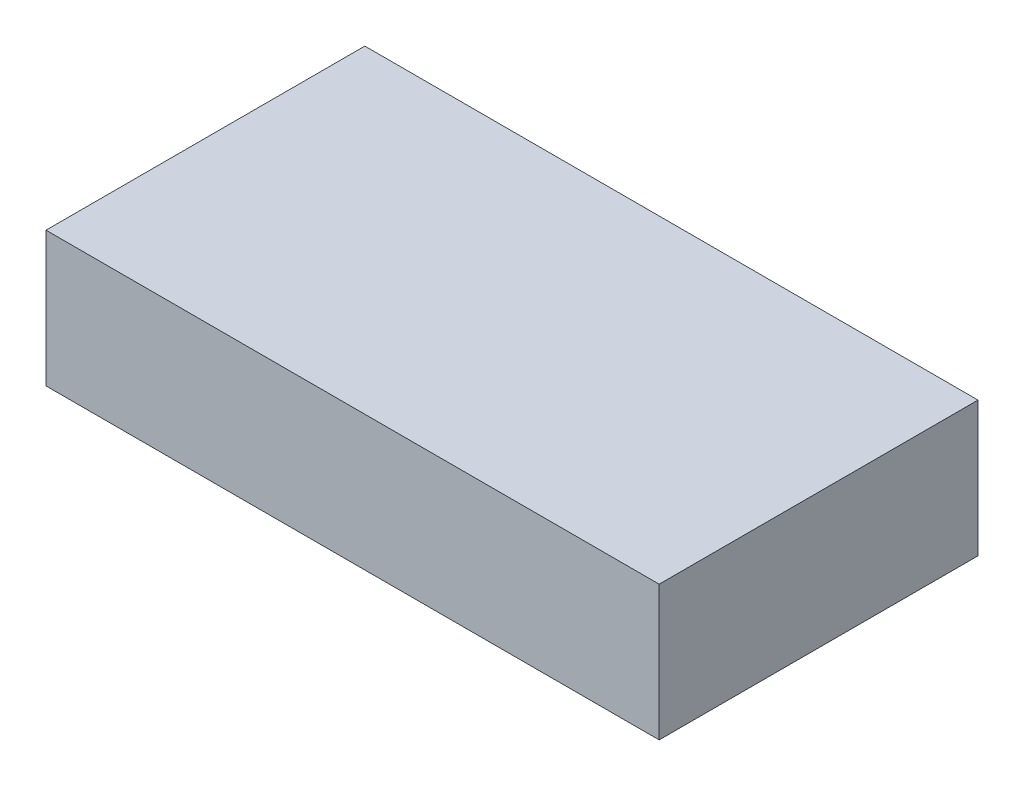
from build123d import *

# Parameters (mm, degrees)
SKETCH1_W           = 127
SKETCH1_H           = 66.04
BOSS_EXTRUDE1_DEPTH = 27.94


with BuildPart() as part:
    # Sketch1 → Boss-Extrude1 (new body)
    with BuildSketch(Plane(origin=(0, 0, 0), x_dir=(1, 0, 0), z_dir=(0, 1, 0))):
        with Locations((63.5, 33.02)):
            Rectangle(SKETCH1_W, SKETCH1_H)
    extrude(amount=BOSS_EXTRUDE1_DEPTH)


solid = part.part
